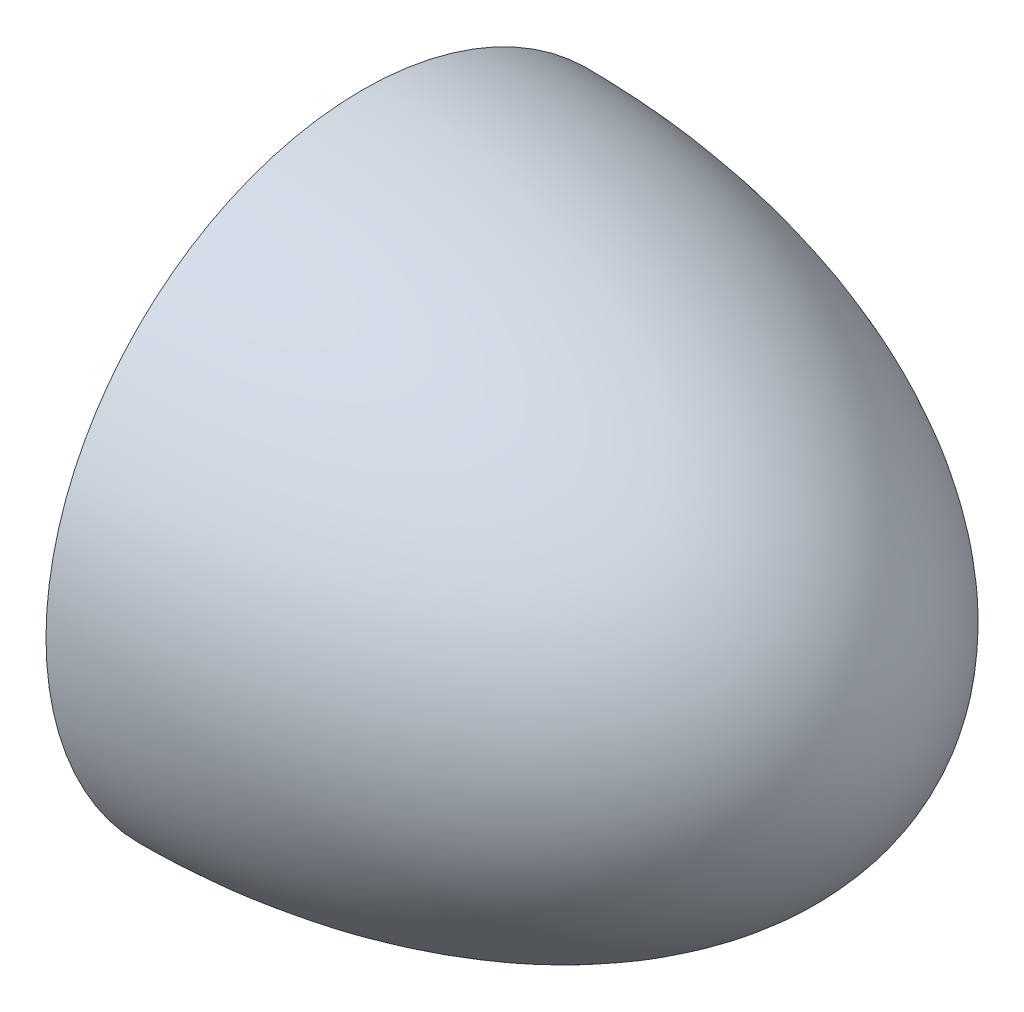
from build123d import *


with BuildPart() as part:
    # Sketch1 → Revolve1 (revolve)
    with BuildSketch(Plane.XY):
        with BuildLine():
            Line((0, 5.74), (0, 0))
            Line((0, 0), (9.58, 0))
            add(Edge.make_bspline(
                [(9.58, 0), (9.58, 5.74), (0, 5.74)],
                knots=[0, 0, 0, 1.570796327, 1.570796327, 1.570796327], degree=2, weights=[1, 0.707106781, 1]))
        make_face()
    revolve(axis=Axis((0, 0, 0), (1, 0, 0)))


solid = part.part
